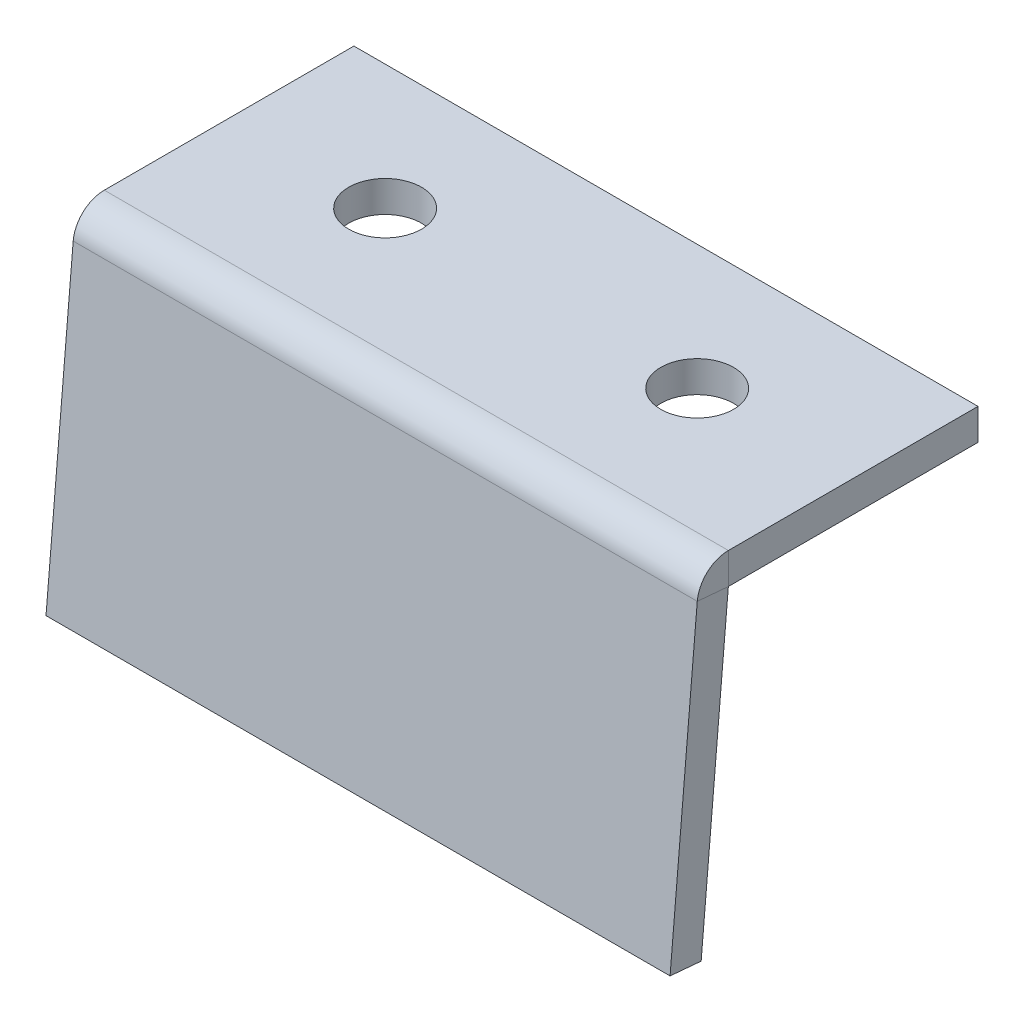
ISO-10303-21;
HEADER;
FILE_DESCRIPTION(('STEP AP214'),'2;1');
FILE_NAME('part.step','',(''),(''),'','','');
FILE_SCHEMA(('AUTOMOTIVE_DESIGN { 1 0 10303 214 1 1 1 1 }'));
ENDSEC;
DATA;
#1=APPLICATION_CONTEXT('core data for automotive mechanical design processes');
#2=APPLICATION_PROTOCOL_DEFINITION('international standard','automotive_design',2000,#1);
#3=PRODUCT_CONTEXT('',#1,'mechanical');
#4=PRODUCT('Part','Part','',(#3));
#5=PRODUCT_RELATED_PRODUCT_CATEGORY('part','',(#4));
#6=PRODUCT_DEFINITION_FORMATION('','',#4);
#7=PRODUCT_DEFINITION_CONTEXT('part definition',#1,'design');
#8=PRODUCT_DEFINITION('design','',#6,#7);
#9=PRODUCT_DEFINITION_SHAPE('','',#8);
#10=(LENGTH_UNIT() NAMED_UNIT(*) SI_UNIT(.MILLI.,.METRE.));
#11=(NAMED_UNIT(*) PLANE_ANGLE_UNIT() SI_UNIT($,.RADIAN.));
#12=(NAMED_UNIT(*) SI_UNIT($,.STERADIAN.) SOLID_ANGLE_UNIT());
#13=UNCERTAINTY_MEASURE_WITH_UNIT(LENGTH_MEASURE(1.E-05),#10,'distance_accuracy_value','');
#14=(GEOMETRIC_REPRESENTATION_CONTEXT(3) GLOBAL_UNCERTAINTY_ASSIGNED_CONTEXT((#13)) GLOBAL_UNIT_ASSIGNED_CONTEXT((#10,
#11,#12)) REPRESENTATION_CONTEXT('',''));
#15=CARTESIAN_POINT('',(0.,0.,0.));
#16=DIRECTION('',(0.,0.,1.));
#17=DIRECTION('',(1.,0.,0.));
#18=AXIS2_PLACEMENT_3D('',#15,#16,#17);
#19=CARTESIAN_POINT('',(0.,11.9549235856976,-16.0450039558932));
#20=DIRECTION('',(0.,-0.087155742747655,-0.996194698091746));
#21=DIRECTION('',(0.,0.996194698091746,-0.087155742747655));
#22=AXIS2_PLACEMENT_3D('',#19,#20,#21);
#23=PLANE('',#22);
#24=DIRECTION('',(0.,-0.996194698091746,0.087155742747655));
#25=VECTOR('',#24,1.);
#26=CARTESIAN_POINT('',(0.,-14.9423332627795,-13.6917989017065));
#27=LINE('',#26,#25);
#28=CARTESIAN_POINT('',(0.,-0.000912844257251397,-14.9990038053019));
#29=VERTEX_POINT('',#28);
#30=CARTESIAN_POINT('',(0.,-14.9423332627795,-13.6917989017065));
#31=VERTEX_POINT('',#30);
#32=EDGE_CURVE('E54',#29,#31,#27,.T.);
#33=ORIENTED_EDGE('',*,*,#32,.F.);
#34=DIRECTION('',(1.,0.,0.));
#35=VECTOR('',#34,1.);
#36=CARTESIAN_POINT('',(0.,-0.000912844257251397,-14.9990038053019));
#37=LINE('',#36,#35);
#38=CARTESIAN_POINT('',(30.,-0.000912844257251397,-14.9990038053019));
#39=VERTEX_POINT('',#38);
#40=EDGE_CURVE('E46',#29,#39,#37,.T.);
#41=ORIENTED_EDGE('',*,*,#40,.T.);
#42=DIRECTION('',(0.,0.996194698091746,-0.087155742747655));
#43=VECTOR('',#42,1.);
#44=CARTESIAN_POINT('',(30.,-14.9423332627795,-13.6917989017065));
#45=LINE('',#44,#43);
#46=CARTESIAN_POINT('',(30.,-14.9423332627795,-13.6917989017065));
#47=VERTEX_POINT('',#46);
#48=EDGE_CURVE('E62',#47,#39,#45,.T.);
#49=ORIENTED_EDGE('',*,*,#48,.F.);
#50=DIRECTION('',(1.,0.,0.));
#51=VECTOR('',#50,1.);
#52=CARTESIAN_POINT('',(0.,-14.9423332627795,-13.6917989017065));
#53=LINE('',#52,#51);
#54=EDGE_CURVE('E175',#31,#47,#53,.T.);
#55=ORIENTED_EDGE('',*,*,#54,.F.);
#56=EDGE_LOOP('',(#33,#41,#49,#55));
#57=FACE_BOUND('',#56,.T.);
#58=ADVANCED_FACE('F37',(#57),#23,.T.);
#59=CARTESIAN_POINT('',(0.,12.0856571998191,-14.5507119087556));
#60=DIRECTION('',(0.,-0.087155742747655,-0.996194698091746));
#61=DIRECTION('',(0.,0.996194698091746,-0.087155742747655));
#62=AXIS2_PLACEMENT_3D('',#59,#60,#61);
#63=PLANE('',#62);
#64=DIRECTION('',(1.,0.,0.));
#65=VECTOR('',#64,1.);
#66=CARTESIAN_POINT('',(0.,0.129820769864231,-13.5047117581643));
#67=LINE('',#66,#65);
#68=CARTESIAN_POINT('',(0.,0.129820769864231,-13.5047117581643));
#69=VERTEX_POINT('',#68);
#70=CARTESIAN_POINT('',(30.,0.129820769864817,-13.5047117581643));
#71=VERTEX_POINT('',#70);
#72=EDGE_CURVE('E182',#69,#71,#67,.T.);
#73=ORIENTED_EDGE('',*,*,#72,.F.);
#74=DIRECTION('',(0.,-0.996194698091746,0.087155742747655));
#75=VECTOR('',#74,1.);
#76=CARTESIAN_POINT('',(0.,-14.811599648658,-12.1975068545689));
#77=LINE('',#76,#75);
#78=CARTESIAN_POINT('',(0.,-14.811599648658,-12.1975068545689));
#79=VERTEX_POINT('',#78);
#80=EDGE_CURVE('E41',#69,#79,#77,.T.);
#81=ORIENTED_EDGE('',*,*,#80,.T.);
#82=DIRECTION('',(1.,0.,0.));
#83=VECTOR('',#82,1.);
#84=CARTESIAN_POINT('',(0.,-14.811599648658,-12.1975068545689));
#85=LINE('',#84,#83);
#86=CARTESIAN_POINT('',(30.,-14.811599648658,-12.1975068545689));
#87=VERTEX_POINT('',#86);
#88=EDGE_CURVE('E172',#79,#87,#85,.T.);
#89=ORIENTED_EDGE('',*,*,#88,.T.);
#90=DIRECTION('',(0.,0.996194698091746,-0.087155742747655));
#91=VECTOR('',#90,1.);
#92=CARTESIAN_POINT('',(30.,-14.811599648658,-12.1975068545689));
#93=LINE('',#92,#91);
#94=EDGE_CURVE('E174',#87,#71,#93,.T.);
#95=ORIENTED_EDGE('',*,*,#94,.T.);
#96=EDGE_LOOP('',(#73,#81,#89,#95));
#97=FACE_BOUND('',#96,.T.);
#98=ADVANCED_FACE('F192',(#97),#63,.F.);
#99=CARTESIAN_POINT('',(0.,-14.811599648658,-12.1975068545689));
#100=DIRECTION('',(1.,0.,0.));
#101=DIRECTION('',(0.,0.996194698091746,-0.087155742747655));
#102=AXIS2_PLACEMENT_3D('',#99,#100,#101);
#103=PLANE('',#102);
#104=DIRECTION('',(0.,0.0871557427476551,0.996194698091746));
#105=VECTOR('',#104,1.);
#106=CARTESIAN_POINT('',(0.,0.129820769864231,-13.5047117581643));
#107=LINE('',#106,#105);
#108=EDGE_CURVE('E12',#29,#69,#107,.T.);
#109=ORIENTED_EDGE('',*,*,#108,.F.);
#110=ORIENTED_EDGE('',*,*,#32,.T.);
#111=DIRECTION('',(0.,-0.087155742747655,-0.996194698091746));
#112=VECTOR('',#111,1.);
#113=CARTESIAN_POINT('',(0.,-14.811599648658,-12.1975068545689));
#114=LINE('',#113,#112);
#115=EDGE_CURVE('E179',#79,#31,#114,.T.);
#116=ORIENTED_EDGE('',*,*,#115,.F.);
#117=ORIENTED_EDGE('',*,*,#80,.F.);
#118=EDGE_LOOP('',(#109,#110,#116,#117));
#119=FACE_BOUND('',#118,.T.);
#120=ADVANCED_FACE('F39',(#119),#103,.F.);
#121=CARTESIAN_POINT('',(0.,-14.811599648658,-12.1975068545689));
#122=DIRECTION('',(0.,0.996194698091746,-0.087155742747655));
#123=DIRECTION('',(-1.,0.,0.));
#124=AXIS2_PLACEMENT_3D('',#121,#122,#123);
#125=PLANE('',#124);
#126=ORIENTED_EDGE('',*,*,#54,.T.);
#127=DIRECTION('',(0.,-0.087155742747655,-0.996194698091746));
#128=VECTOR('',#127,1.);
#129=CARTESIAN_POINT('',(30.,-14.811599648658,-12.1975068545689));
#130=LINE('',#129,#128);
#131=EDGE_CURVE('E177',#87,#47,#130,.T.);
#132=ORIENTED_EDGE('',*,*,#131,.F.);
#133=ORIENTED_EDGE('',*,*,#88,.F.);
#134=ORIENTED_EDGE('',*,*,#115,.T.);
#135=EDGE_LOOP('',(#126,#132,#133,#134));
#136=FACE_BOUND('',#135,.T.);
#137=ADVANCED_FACE('F208',(#136),#125,.F.);
#138=CARTESIAN_POINT('',(30.,-14.811599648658,-12.1975068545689));
#139=DIRECTION('',(-1.,0.,0.));
#140=DIRECTION('',(0.,-0.996194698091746,0.087155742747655));
#141=AXIS2_PLACEMENT_3D('',#138,#139,#140);
#142=PLANE('',#141);
#143=DIRECTION('',(0.,-0.0871557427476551,-0.996194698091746));
#144=VECTOR('',#143,1.);
#145=CARTESIAN_POINT('',(30.,0.129820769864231,-13.5047117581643));
#146=LINE('',#145,#144);
#147=EDGE_CURVE('E184',#71,#39,#146,.T.);
#148=ORIENTED_EDGE('',*,*,#147,.F.);
#149=ORIENTED_EDGE('',*,*,#94,.F.);
#150=ORIENTED_EDGE('',*,*,#131,.T.);
#151=ORIENTED_EDGE('',*,*,#48,.T.);
#152=EDGE_LOOP('',(#148,#149,#150,#151));
#153=FACE_BOUND('',#152,.T.);
#154=ADVANCED_FACE('F215',(#153),#142,.F.);
#155=CARTESIAN_POINT('',(0.,1.5,-27.));
#156=DIRECTION('',(0.,0.,1.));
#157=DIRECTION('',(1.,0.,0.));
#158=AXIS2_PLACEMENT_3D('',#155,#156,#157);
#159=PLANE('',#158);
#160=DIRECTION('',(-1.,0.,0.));
#161=VECTOR('',#160,1.);
#162=CARTESIAN_POINT('',(0.,0.,-27.));
#163=LINE('',#162,#161);
#164=CARTESIAN_POINT('',(30.,0.,-27.));
#165=VERTEX_POINT('',#164);
#166=CARTESIAN_POINT('',(0.,0.,-27.));
#167=VERTEX_POINT('',#166);
#168=EDGE_CURVE('E168',#165,#167,#163,.T.);
#169=ORIENTED_EDGE('',*,*,#168,.T.);
#170=DIRECTION('',(0.,-1.,0.));
#171=VECTOR('',#170,1.);
#172=CARTESIAN_POINT('',(0.,1.5,-27.));
#173=LINE('',#172,#171);
#174=CARTESIAN_POINT('',(0.,1.5,-27.));
#175=VERTEX_POINT('',#174);
#176=EDGE_CURVE('E141',#175,#167,#173,.T.);
#177=ORIENTED_EDGE('',*,*,#176,.F.);
#178=DIRECTION('',(-1.,0.,0.));
#179=VECTOR('',#178,1.);
#180=CARTESIAN_POINT('',(0.,1.5,-27.));
#181=LINE('',#180,#179);
#182=CARTESIAN_POINT('',(30.,1.5,-27.));
#183=VERTEX_POINT('',#182);
#184=EDGE_CURVE('E130',#183,#175,#181,.T.);
#185=ORIENTED_EDGE('',*,*,#184,.F.);
#186=DIRECTION('',(0.,-1.,0.));
#187=VECTOR('',#186,1.);
#188=CARTESIAN_POINT('',(30.,1.5,-27.));
#189=LINE('',#188,#187);
#190=EDGE_CURVE('E165',#183,#165,#189,.T.);
#191=ORIENTED_EDGE('',*,*,#190,.T.);
#192=EDGE_LOOP('',(#169,#177,#185,#191));
#193=FACE_BOUND('',#192,.T.);
#194=ADVANCED_FACE('F223',(#193),#159,.F.);
#195=CARTESIAN_POINT('',(7.5,1.5,-21.));
#196=DIRECTION('',(0.,-1.,0.));
#197=DIRECTION('',(0.,0.,-1.));
#198=AXIS2_PLACEMENT_3D('',#195,#196,#197);
#199=CYLINDRICAL_SURFACE('',#198,1.75);
#200=CARTESIAN_POINT('',(7.5,1.5,-21.));
#201=DIRECTION('',(0.,1.,0.));
#202=DIRECTION('',(0.,0.,1.));
#203=AXIS2_PLACEMENT_3D('',#200,#201,#202);
#204=CIRCLE('',#203,1.75);
#205=CARTESIAN_POINT('',(7.5,1.5,-19.25));
#206=VERTEX_POINT('',#205);
#207=EDGE_CURVE('E162',#206,#206,#204,.T.);
#208=ORIENTED_EDGE('',*,*,#207,.T.);
#209=EDGE_LOOP('',(#208));
#210=FACE_BOUND('',#209,.T.);
#211=CARTESIAN_POINT('',(7.5,0.,-21.));
#212=DIRECTION('',(0.,1.,0.));
#213=DIRECTION('',(0.,0.,1.));
#214=AXIS2_PLACEMENT_3D('',#211,#212,#213);
#215=CIRCLE('',#214,1.75);
#216=CARTESIAN_POINT('',(7.5,0.,-19.25));
#217=VERTEX_POINT('',#216);
#218=EDGE_CURVE('E150',#217,#217,#215,.T.);
#219=ORIENTED_EDGE('',*,*,#218,.F.);
#220=EDGE_LOOP('',(#219));
#221=FACE_BOUND('',#220,.T.);
#222=ADVANCED_FACE('F241',(#210,#221),#199,.F.);
#223=CARTESIAN_POINT('',(22.5,1.5,-21.));
#224=DIRECTION('',(0.,-1.,0.));
#225=DIRECTION('',(0.,0.,-1.));
#226=AXIS2_PLACEMENT_3D('',#223,#224,#225);
#227=CYLINDRICAL_SURFACE('',#226,1.75);
#228=CARTESIAN_POINT('',(22.5,1.5,-21.));
#229=DIRECTION('',(0.,1.,0.));
#230=DIRECTION('',(0.,0.,1.));
#231=AXIS2_PLACEMENT_3D('',#228,#229,#230);
#232=CIRCLE('',#231,1.75);
#233=CARTESIAN_POINT('',(22.5,1.5,-19.25));
#234=VERTEX_POINT('',#233);
#235=EDGE_CURVE('E134',#234,#234,#232,.T.);
#236=ORIENTED_EDGE('',*,*,#235,.T.);
#237=EDGE_LOOP('',(#236));
#238=FACE_BOUND('',#237,.T.);
#239=CARTESIAN_POINT('',(22.5,0.,-21.));
#240=DIRECTION('',(0.,1.,0.));
#241=DIRECTION('',(0.,0.,1.));
#242=AXIS2_PLACEMENT_3D('',#239,#240,#241);
#243=CIRCLE('',#242,1.75);
#244=CARTESIAN_POINT('',(22.5,0.,-19.25));
#245=VERTEX_POINT('',#244);
#246=EDGE_CURVE('E144',#245,#245,#243,.T.);
#247=ORIENTED_EDGE('',*,*,#246,.F.);
#248=EDGE_LOOP('',(#247));
#249=FACE_BOUND('',#248,.T.);
#250=ADVANCED_FACE('F237',(#238,#249),#227,.F.);
#251=CARTESIAN_POINT('',(0.,1.5,-27.));
#252=DIRECTION('',(0.,-1.,0.));
#253=DIRECTION('',(0.,0.,-1.));
#254=AXIS2_PLACEMENT_3D('',#251,#252,#253);
#255=PLANE('',#254);
#256=ORIENTED_EDGE('',*,*,#235,.F.);
#257=EDGE_LOOP('',(#256));
#258=FACE_BOUND('',#257,.T.);
#259=ORIENTED_EDGE('',*,*,#207,.F.);
#260=EDGE_LOOP('',(#259));
#261=FACE_BOUND('',#260,.T.);
#262=DIRECTION('',(0.,0.,1.));
#263=VECTOR('',#262,1.);
#264=CARTESIAN_POINT('',(0.,1.5,0.));
#265=LINE('',#264,#263);
#266=CARTESIAN_POINT('',(0.,1.5,-15.));
#267=VERTEX_POINT('',#266);
#268=EDGE_CURVE('E125',#175,#267,#265,.T.);
#269=ORIENTED_EDGE('',*,*,#268,.T.);
#270=DIRECTION('',(1.,0.,0.));
#271=VECTOR('',#270,1.);
#272=CARTESIAN_POINT('',(0.,1.5,-15.));
#273=LINE('',#272,#271);
#274=CARTESIAN_POINT('',(30.,1.5,-15.));
#275=VERTEX_POINT('',#274);
#276=EDGE_CURVE('E118',#267,#275,#273,.T.);
#277=ORIENTED_EDGE('',*,*,#276,.T.);
#278=DIRECTION('',(0.,0.,-1.));
#279=VECTOR('',#278,1.);
#280=CARTESIAN_POINT('',(30.,1.5,0.));
#281=LINE('',#280,#279);
#282=EDGE_CURVE('E124',#275,#183,#281,.T.);
#283=ORIENTED_EDGE('',*,*,#282,.T.);
#284=ORIENTED_EDGE('',*,*,#184,.T.);
#285=EDGE_LOOP('',(#269,#277,#283,#284));
#286=FACE_BOUND('',#285,.T.);
#287=ADVANCED_FACE('F128',(#258,#261,#286),#255,.F.);
#288=CARTESIAN_POINT('',(30.,1.5,0.));
#289=DIRECTION('',(-1.,0.,0.));
#290=DIRECTION('',(0.,0.,1.));
#291=AXIS2_PLACEMENT_3D('',#288,#289,#290);
#292=PLANE('',#291);
#293=ORIENTED_EDGE('',*,*,#282,.F.);
#294=DIRECTION('',(0.,-1.,0.));
#295=VECTOR('',#294,1.);
#296=CARTESIAN_POINT('',(30.,1.5,-15.));
#297=LINE('',#296,#295);
#298=CARTESIAN_POINT('',(30.,0.,-15.));
#299=VERTEX_POINT('',#298);
#300=EDGE_CURVE('E155',#275,#299,#297,.T.);
#301=ORIENTED_EDGE('',*,*,#300,.T.);
#302=DIRECTION('',(0.,0.,-1.));
#303=VECTOR('',#302,1.);
#304=CARTESIAN_POINT('',(30.,0.,0.));
#305=LINE('',#304,#303);
#306=EDGE_CURVE('E153',#299,#165,#305,.T.);
#307=ORIENTED_EDGE('',*,*,#306,.T.);
#308=ORIENTED_EDGE('',*,*,#190,.F.);
#309=EDGE_LOOP('',(#293,#301,#307,#308));
#310=FACE_BOUND('',#309,.T.);
#311=ADVANCED_FACE('F230',(#310),#292,.F.);
#312=CARTESIAN_POINT('',(0.,0.,-27.));
#313=DIRECTION('',(0.,-1.,0.));
#314=DIRECTION('',(0.,0.,-1.));
#315=AXIS2_PLACEMENT_3D('',#312,#313,#314);
#316=PLANE('',#315);
#317=DIRECTION('',(1.,0.,0.));
#318=VECTOR('',#317,1.);
#319=CARTESIAN_POINT('',(0.,0.,-15.));
#320=LINE('',#319,#318);
#321=CARTESIAN_POINT('',(0.,0.,-15.));
#322=VERTEX_POINT('',#321);
#323=EDGE_CURVE('E170',#322,#299,#320,.T.);
#324=ORIENTED_EDGE('',*,*,#323,.F.);
#325=DIRECTION('',(0.,0.,1.));
#326=VECTOR('',#325,1.);
#327=CARTESIAN_POINT('',(0.,0.,0.));
#328=LINE('',#327,#326);
#329=EDGE_CURVE('E139',#167,#322,#328,.T.);
#330=ORIENTED_EDGE('',*,*,#329,.F.);
#331=ORIENTED_EDGE('',*,*,#168,.F.);
#332=ORIENTED_EDGE('',*,*,#306,.F.);
#333=EDGE_LOOP('',(#324,#330,#331,#332));
#334=FACE_BOUND('',#333,.T.);
#335=ORIENTED_EDGE('',*,*,#218,.T.);
#336=EDGE_LOOP('',(#335));
#337=FACE_BOUND('',#336,.T.);
#338=ORIENTED_EDGE('',*,*,#246,.T.);
#339=EDGE_LOOP('',(#338));
#340=FACE_BOUND('',#339,.T.);
#341=ADVANCED_FACE('F227',(#334,#337,#340),#316,.T.);
#342=CARTESIAN_POINT('',(0.,1.5,0.));
#343=DIRECTION('',(1.,0.,0.));
#344=DIRECTION('',(0.,0.,-1.));
#345=AXIS2_PLACEMENT_3D('',#342,#343,#344);
#346=PLANE('',#345);
#347=ORIENTED_EDGE('',*,*,#329,.T.);
#348=DIRECTION('',(0.,1.,0.));
#349=VECTOR('',#348,1.);
#350=CARTESIAN_POINT('',(0.,1.5,-15.));
#351=LINE('',#350,#349);
#352=EDGE_CURVE('E109',#322,#267,#351,.T.);
#353=ORIENTED_EDGE('',*,*,#352,.T.);
#354=ORIENTED_EDGE('',*,*,#268,.F.);
#355=ORIENTED_EDGE('',*,*,#176,.T.);
#356=EDGE_LOOP('',(#347,#353,#354,#355));
#357=FACE_BOUND('',#356,.T.);
#358=ADVANCED_FACE('F137',(#357),#346,.F.);
#359=CARTESIAN_POINT('',(0.,-0.000999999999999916,-15.));
#360=DIRECTION('',(-1.,0.,0.));
#361=DIRECTION('',(0.,-1.,0.));
#362=AXIS2_PLACEMENT_3D('',#359,#360,#361);
#363=PLANE('',#362);
#364=ORIENTED_EDGE('',*,*,#352,.F.);
#365=CARTESIAN_POINT('',(0.,-0.000999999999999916,-15.));
#366=DIRECTION('',(1.,0.,0.));
#367=DIRECTION('',(0.,0.,-1.));
#368=AXIS2_PLACEMENT_3D('',#365,#366,#367);
#369=CIRCLE('',#368,0.000999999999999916);
#370=EDGE_CURVE('E202',#322,#29,#369,.T.);
#371=ORIENTED_EDGE('',*,*,#370,.T.);
#372=ORIENTED_EDGE('',*,*,#108,.T.);
#373=CARTESIAN_POINT('',(0.,-0.000999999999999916,-15.));
#374=DIRECTION('',(1.,0.,0.));
#375=DIRECTION('',(0.,1.,0.));
#376=AXIS2_PLACEMENT_3D('',#373,#374,#375);
#377=CIRCLE('',#376,1.501);
#378=EDGE_CURVE('E104',#267,#69,#377,.T.);
#379=ORIENTED_EDGE('',*,*,#378,.F.);
#380=EDGE_LOOP('',(#364,#371,#372,#379));
#381=FACE_BOUND('',#380,.T.);
#382=ADVANCED_FACE('F106',(#381),#363,.T.);
#383=CARTESIAN_POINT('',(30.,-0.000999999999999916,-15.));
#384=DIRECTION('',(1.,0.,0.));
#385=DIRECTION('',(0.,0.,-1.));
#386=AXIS2_PLACEMENT_3D('',#383,#384,#385);
#387=PLANE('',#386);
#388=ORIENTED_EDGE('',*,*,#147,.T.);
#389=CARTESIAN_POINT('',(30.,-0.000999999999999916,-15.));
#390=DIRECTION('',(1.,0.,0.));
#391=DIRECTION('',(0.,0.,-1.));
#392=AXIS2_PLACEMENT_3D('',#389,#390,#391);
#393=CIRCLE('',#392,0.000999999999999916);
#394=EDGE_CURVE('E114',#39,#299,#393,.F.);
#395=ORIENTED_EDGE('',*,*,#394,.T.);
#396=ORIENTED_EDGE('',*,*,#300,.F.);
#397=CARTESIAN_POINT('',(30.,-0.000999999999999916,-15.));
#398=DIRECTION('',(-1.,0.,0.));
#399=DIRECTION('',(0.,0.,1.));
#400=AXIS2_PLACEMENT_3D('',#397,#398,#399);
#401=CIRCLE('',#400,1.501);
#402=EDGE_CURVE('E113',#71,#275,#401,.T.);
#403=ORIENTED_EDGE('',*,*,#402,.F.);
#404=EDGE_LOOP('',(#388,#395,#396,#403));
#405=FACE_BOUND('',#404,.T.);
#406=ADVANCED_FACE('F197',(#405),#387,.T.);
#407=CARTESIAN_POINT('',(-15.0374766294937,-0.000999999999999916,-15.));
#408=DIRECTION('',(1.,0.,0.));
#409=DIRECTION('',(0.,0.,-1.));
#410=AXIS2_PLACEMENT_3D('',#407,#408,#409);
#411=CYLINDRICAL_SURFACE('',#410,1.501);
#412=ORIENTED_EDGE('',*,*,#402,.T.);
#413=ORIENTED_EDGE('',*,*,#276,.F.);
#414=ORIENTED_EDGE('',*,*,#378,.T.);
#415=ORIENTED_EDGE('',*,*,#72,.T.);
#416=EDGE_LOOP('',(#412,#413,#414,#415));
#417=FACE_BOUND('',#416,.T.);
#418=ADVANCED_FACE('F120',(#417),#411,.T.);
#419=CARTESIAN_POINT('',(-15.0374766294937,-0.000999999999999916,-15.));
#420=DIRECTION('',(1.,0.,0.));
#421=DIRECTION('',(0.,0.,-1.));
#422=AXIS2_PLACEMENT_3D('',#419,#420,#421);
#423=CYLINDRICAL_SURFACE('',#422,0.000999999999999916);
#424=ORIENTED_EDGE('',*,*,#394,.F.);
#425=ORIENTED_EDGE('',*,*,#40,.F.);
#426=ORIENTED_EDGE('',*,*,#370,.F.);
#427=ORIENTED_EDGE('',*,*,#323,.T.);
#428=EDGE_LOOP('',(#424,#425,#426,#427));
#429=FACE_BOUND('',#428,.T.);
#430=ADVANCED_FACE('F205',(#429),#423,.F.);
#431=CLOSED_SHELL('',(#58,#98,#120,#137,#154,#194,#222,#250,#287,#311,#341,#358,#382,#406,#418,#430));
#432=MANIFOLD_SOLID_BREP('B2',#431);
#433=ADVANCED_BREP_SHAPE_REPRESENTATION('',(#18,#432),#14);
#434=SHAPE_DEFINITION_REPRESENTATION(#9,#433);
ENDSEC;
END-ISO-10303-21;
